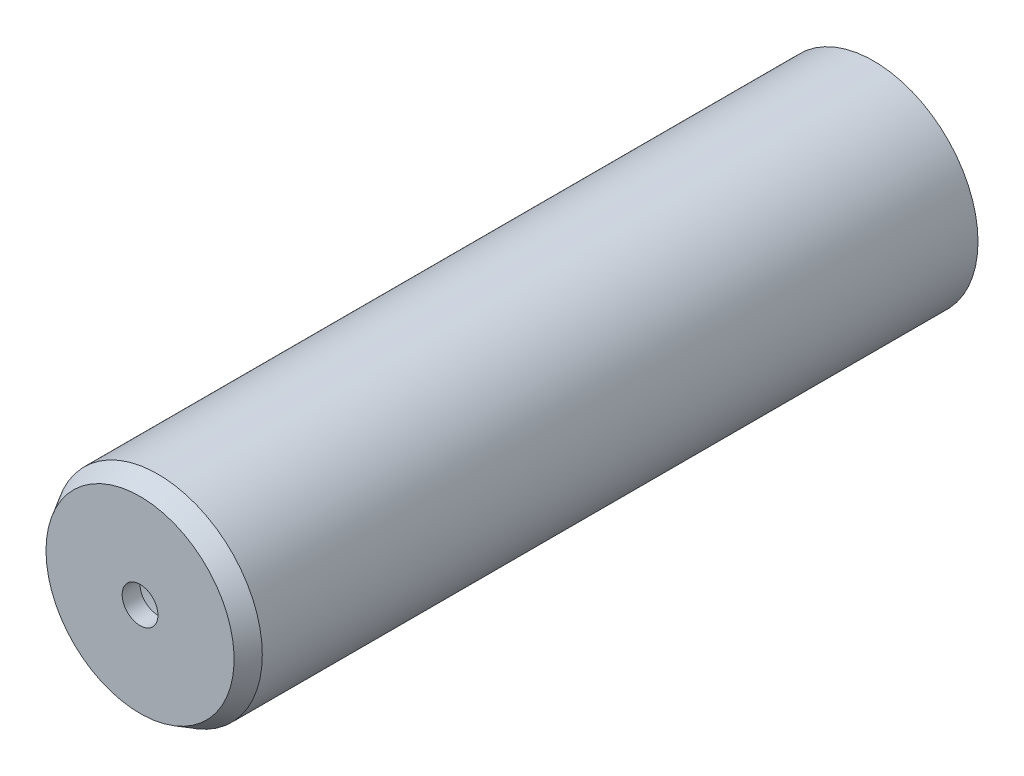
ISO-10303-21;
HEADER;
FILE_DESCRIPTION(('STEP AP214'),'2;1');
FILE_NAME('part.step','',(''),(''),'','','');
FILE_SCHEMA(('AUTOMOTIVE_DESIGN { 1 0 10303 214 1 1 1 1 }'));
ENDSEC;
DATA;
#1=APPLICATION_CONTEXT('core data for automotive mechanical design processes');
#2=APPLICATION_PROTOCOL_DEFINITION('international standard','automotive_design',2000,#1);
#3=PRODUCT_CONTEXT('',#1,'mechanical');
#4=PRODUCT('Part','Part','',(#3));
#5=PRODUCT_RELATED_PRODUCT_CATEGORY('part','',(#4));
#6=PRODUCT_DEFINITION_FORMATION('','',#4);
#7=PRODUCT_DEFINITION_CONTEXT('part definition',#1,'design');
#8=PRODUCT_DEFINITION('design','',#6,#7);
#9=PRODUCT_DEFINITION_SHAPE('','',#8);
#10=(LENGTH_UNIT() NAMED_UNIT(*) SI_UNIT(.MILLI.,.METRE.));
#11=(NAMED_UNIT(*) PLANE_ANGLE_UNIT() SI_UNIT($,.RADIAN.));
#12=(NAMED_UNIT(*) SI_UNIT($,.STERADIAN.) SOLID_ANGLE_UNIT());
#13=UNCERTAINTY_MEASURE_WITH_UNIT(LENGTH_MEASURE(1.E-05),#10,'distance_accuracy_value','');
#14=(GEOMETRIC_REPRESENTATION_CONTEXT(3) GLOBAL_UNCERTAINTY_ASSIGNED_CONTEXT((#13)) GLOBAL_UNIT_ASSIGNED_CONTEXT((#10,
#11,#12)) REPRESENTATION_CONTEXT('',''));
#15=CARTESIAN_POINT('',(0.,0.,0.));
#16=DIRECTION('',(0.,0.,1.));
#17=DIRECTION('',(1.,0.,0.));
#18=AXIS2_PLACEMENT_3D('',#15,#16,#17);
#19=CARTESIAN_POINT('',(-1.95017537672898,9.604,20.));
#20=DIRECTION('',(-0.98,-0.198997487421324,0.));
#21=DIRECTION('',(0.198997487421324,-0.98,0.));
#22=AXIS2_PLACEMENT_3D('',#19,#20,#21);
#23=PLANE('',#22);
#24=DIRECTION('',(0.,0.,-1.));
#25=VECTOR('',#24,1.);
#26=CARTESIAN_POINT('',(-2.98496231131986,14.7,20.));
#27=LINE('',#26,#25);
#28=CARTESIAN_POINT('',(-2.98496231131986,14.7,20.));
#29=VERTEX_POINT('',#28);
#30=CARTESIAN_POINT('',(-2.98496231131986,14.7,6.));
#31=VERTEX_POINT('',#30);
#32=EDGE_CURVE('E102',#29,#31,#27,.T.);
#33=ORIENTED_EDGE('',*,*,#32,.T.);
#34=DIRECTION('',(-0.198997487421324,0.98,0.));
#35=VECTOR('',#34,1.);
#36=CARTESIAN_POINT('',(-1.95017537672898,9.604,6.));
#37=LINE('',#36,#35);
#38=CARTESIAN_POINT('',(-1.95017537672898,9.604,6.));
#39=VERTEX_POINT('',#38);
#40=EDGE_CURVE('E96',#39,#31,#37,.T.);
#41=ORIENTED_EDGE('',*,*,#40,.F.);
#42=DIRECTION('',(0.,0.,-1.));
#43=VECTOR('',#42,1.);
#44=CARTESIAN_POINT('',(-1.95017537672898,9.604,20.));
#45=LINE('',#44,#43);
#46=CARTESIAN_POINT('',(-1.95017537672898,9.604,6.26261290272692));
#47=VERTEX_POINT('',#46);
#48=EDGE_CURVE('E95',#47,#39,#45,.T.);
#49=ORIENTED_EDGE('',*,*,#48,.F.);
#50=DIRECTION('',(0.0680611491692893,-0.335179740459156,-0.939692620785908));
#51=VECTOR('',#50,1.);
#52=CARTESIAN_POINT('',(-2.82877139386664,13.9308088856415,18.3930309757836));
#53=LINE('',#52,#51);
#54=CARTESIAN_POINT('',(-2.9451628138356,14.504,20.));
#55=VERTEX_POINT('',#54);
#56=EDGE_CURVE('E131',#47,#55,#53,.F.);
#57=ORIENTED_EDGE('',*,*,#56,.T.);
#58=DIRECTION('',(-0.198997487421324,0.98,0.));
#59=VECTOR('',#58,1.);
#60=CARTESIAN_POINT('',(-1.95017537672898,9.604,20.));
#61=LINE('',#60,#59);
#62=EDGE_CURVE('E104',#55,#29,#61,.T.);
#63=ORIENTED_EDGE('',*,*,#62,.T.);
#64=EDGE_LOOP('',(#33,#41,#49,#57,#63));
#65=FACE_BOUND('',#64,.T.);
#66=ADVANCED_FACE('F35',(#65),#23,.T.);
#67=CARTESIAN_POINT('',(0.,10.,20.));
#68=DIRECTION('',(0.198997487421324,-0.98,0.));
#69=DIRECTION('',(0.98,0.198997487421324,0.));
#70=AXIS2_PLACEMENT_3D('',#67,#68,#69);
#71=PLANE('',#70);
#72=ORIENTED_EDGE('',*,*,#48,.T.);
#73=DIRECTION('',(-0.98,-0.198997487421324,0.));
#74=VECTOR('',#73,1.);
#75=CARTESIAN_POINT('',(0.,10.,6.));
#76=LINE('',#75,#74);
#77=CARTESIAN_POINT('',(0.,10.,6.));
#78=VERTEX_POINT('',#77);
#79=EDGE_CURVE('E82',#78,#39,#76,.T.);
#80=ORIENTED_EDGE('',*,*,#79,.F.);
#81=DIRECTION('',(0.,0.,-1.));
#82=VECTOR('',#81,1.);
#83=CARTESIAN_POINT('',(0.,10.,20.));
#84=LINE('',#83,#82);
#85=CARTESIAN_POINT('',(0.,10.,6.26261290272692));
#86=VERTEX_POINT('',#85);
#87=EDGE_CURVE('E92',#86,#78,#84,.T.);
#88=ORIENTED_EDGE('',*,*,#87,.F.);
#89=DIRECTION('',(-0.98,-0.198997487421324,0.));
#90=VECTOR('',#89,1.);
#91=CARTESIAN_POINT('',(0.,10.,6.26261290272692));
#92=LINE('',#91,#90);
#93=EDGE_CURVE('E129',#86,#47,#92,.T.);
#94=ORIENTED_EDGE('',*,*,#93,.T.);
#95=EDGE_LOOP('',(#72,#80,#88,#94));
#96=FACE_BOUND('',#95,.T.);
#97=ADVANCED_FACE('F90',(#96),#71,.T.);
#98=CARTESIAN_POINT('',(0.,15.,20.));
#99=DIRECTION('',(1.,0.,0.));
#100=DIRECTION('',(0.,1.,0.));
#101=AXIS2_PLACEMENT_3D('',#98,#99,#100);
#102=PLANE('',#101);
#103=ORIENTED_EDGE('',*,*,#87,.T.);
#104=DIRECTION('',(0.,-1.,0.));
#105=VECTOR('',#104,1.);
#106=CARTESIAN_POINT('',(0.,15.,6.));
#107=LINE('',#106,#105);
#108=CARTESIAN_POINT('',(0.,15.,6.));
#109=VERTEX_POINT('',#108);
#110=EDGE_CURVE('E79',#109,#78,#107,.T.);
#111=ORIENTED_EDGE('',*,*,#110,.F.);
#112=DIRECTION('',(0.,0.,-1.));
#113=VECTOR('',#112,1.);
#114=CARTESIAN_POINT('',(0.,15.,20.));
#115=LINE('',#114,#113);
#116=CARTESIAN_POINT('',(0.,15.,19.7252522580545));
#117=VERTEX_POINT('',#116);
#118=EDGE_CURVE('E100',#117,#109,#115,.T.);
#119=ORIENTED_EDGE('',*,*,#118,.F.);
#120=DIRECTION('',(0.,0.34816150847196,0.937434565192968));
#121=VECTOR('',#120,1.);
#122=CARTESIAN_POINT('',(0.,15.0896717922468,19.9666960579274));
#123=LINE('',#122,#121);
#124=EDGE_CURVE('E43',#117,#86,#123,.F.);
#125=ORIENTED_EDGE('',*,*,#124,.T.);
#126=EDGE_LOOP('',(#103,#111,#119,#125));
#127=FACE_BOUND('',#126,.T.);
#128=ADVANCED_FACE('F98',(#127),#102,.T.);
#129=CARTESIAN_POINT('',(0.,0.,0.));
#130=DIRECTION('',(0.,0.,1.));
#131=DIRECTION('',(1.,0.,0.));
#132=AXIS2_PLACEMENT_3D('',#129,#130,#131);
#133=PLANE('',#132);
#134=CARTESIAN_POINT('',(0.,0.,0.));
#135=DIRECTION('',(0.,0.,1.));
#136=DIRECTION('',(1.,0.,0.));
#137=AXIS2_PLACEMENT_3D('',#134,#135,#136);
#138=CIRCLE('',#137,17.5);
#139=CARTESIAN_POINT('',(17.5,0.,0.));
#140=VERTEX_POINT('',#139);
#141=EDGE_CURVE('E120',#140,#140,#138,.T.);
#142=ORIENTED_EDGE('',*,*,#141,.F.);
#143=EDGE_LOOP('',(#142));
#144=FACE_BOUND('',#143,.T.);
#145=CARTESIAN_POINT('',(0.,0.,0.));
#146=DIRECTION('',(0.,0.,1.));
#147=DIRECTION('',(1.,0.,0.));
#148=AXIS2_PLACEMENT_3D('',#145,#146,#147);
#149=CIRCLE('',#148,15.);
#150=CARTESIAN_POINT('',(15.,0.,0.));
#151=VERTEX_POINT('',#150);
#152=EDGE_CURVE('E117',#151,#151,#149,.T.);
#153=ORIENTED_EDGE('',*,*,#152,.T.);
#154=EDGE_LOOP('',(#153));
#155=FACE_BOUND('',#154,.T.);
#156=ADVANCED_FACE('F162',(#144,#155),#133,.F.);
#157=CARTESIAN_POINT('',(0.,0.,120.));
#158=DIRECTION('',(0.,0.,-1.));
#159=DIRECTION('',(-1.,0.,0.));
#160=AXIS2_PLACEMENT_3D('',#157,#158,#159);
#161=CYLINDRICAL_SURFACE('',#160,17.5);
#162=CARTESIAN_POINT('',(0.,0.,120.));
#163=DIRECTION('',(0.,0.,1.));
#164=DIRECTION('',(1.,0.,0.));
#165=AXIS2_PLACEMENT_3D('',#162,#163,#164);
#166=CIRCLE('',#165,17.5);
#167=CARTESIAN_POINT('',(-17.5,0.,120.));
#168=VERTEX_POINT('',#167);
#169=EDGE_CURVE('E126',#168,#168,#166,.F.);
#170=ORIENTED_EDGE('',*,*,#169,.T.);
#171=EDGE_LOOP('',(#170));
#172=FACE_BOUND('',#171,.T.);
#173=ORIENTED_EDGE('',*,*,#141,.T.);
#174=EDGE_LOOP('',(#173));
#175=FACE_BOUND('',#174,.T.);
#176=ADVANCED_FACE('F178',(#172,#175),#161,.T.);
#177=CARTESIAN_POINT('',(0.,0.,120.));
#178=DIRECTION('',(0.,0.,-1.));
#179=DIRECTION('',(-1.,0.,0.));
#180=AXIS2_PLACEMENT_3D('',#177,#178,#179);
#181=CYLINDRICAL_SURFACE('',#180,15.);
#182=ORIENTED_EDGE('',*,*,#152,.F.);
#183=EDGE_LOOP('',(#182));
#184=FACE_BOUND('',#183,.T.);
#185=ORIENTED_EDGE('',*,*,#32,.F.);
#186=CARTESIAN_POINT('',(7.08851380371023E-13,-7.05512037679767E-12,20.));
#187=DIRECTION('',(0.,0.,-1.));
#188=DIRECTION('',(1.,0.,0.));
#189=AXIS2_PLACEMENT_3D('',#186,#187,#188);
#190=CIRCLE('',#189,15.0000000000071);
#191=CARTESIAN_POINT('',(-0.552677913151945,14.9898147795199,20.));
#192=VERTEX_POINT('',#191);
#193=EDGE_CURVE('E139',#29,#192,#190,.T.);
#194=ORIENTED_EDGE('',*,*,#193,.T.);
#195=CARTESIAN_POINT('',(0.,0.,-20.6626658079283));
#196=DIRECTION('',(-0.186996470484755,0.92089876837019,-0.34202014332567));
#197=DIRECTION('',(0.0680611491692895,-0.335179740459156,-0.939692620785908));
#198=AXIS2_PLACEMENT_3D('',#195,#196,#197);
#199=ELLIPSE('',#198,43.8570660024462,15.);
#200=EDGE_CURVE('E11',#192,#117,#199,.T.);
#201=ORIENTED_EDGE('',*,*,#200,.T.);
#202=ORIENTED_EDGE('',*,*,#118,.T.);
#203=CARTESIAN_POINT('',(0.,1.196959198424E-13,6.));
#204=DIRECTION('',(0.,0.,-1.));
#205=DIRECTION('',(-1.,0.,0.));
#206=AXIS2_PLACEMENT_3D('',#203,#204,#205);
#207=CIRCLE('',#206,14.9999999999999);
#208=EDGE_CURVE('E50',#31,#109,#207,.T.);
#209=ORIENTED_EDGE('',*,*,#208,.F.);
#210=EDGE_LOOP('',(#185,#194,#201,#202,#209));
#211=FACE_BOUND('',#210,.T.);
#212=CARTESIAN_POINT('',(0.,0.,120.));
#213=DIRECTION('',(0.,0.,1.));
#214=DIRECTION('',(1.,0.,0.));
#215=AXIS2_PLACEMENT_3D('',#212,#213,#214);
#216=CIRCLE('',#215,15.);
#217=CARTESIAN_POINT('',(15.,0.,120.));
#218=VERTEX_POINT('',#217);
#219=EDGE_CURVE('E111',#218,#218,#216,.T.);
#220=ORIENTED_EDGE('',*,*,#219,.T.);
#221=EDGE_LOOP('',(#220));
#222=FACE_BOUND('',#221,.T.);
#223=ADVANCED_FACE('F142',(#184,#211,#222),#181,.F.);
#224=CARTESIAN_POINT('',(0.,0.,120.));
#225=DIRECTION('',(0.,0.,1.));
#226=DIRECTION('',(1.,0.,0.));
#227=AXIS2_PLACEMENT_3D('',#224,#225,#226);
#228=PLANE('',#227);
#229=CARTESIAN_POINT('',(0.,0.,120.));
#230=DIRECTION('',(0.,0.,1.));
#231=DIRECTION('',(1.,0.,0.));
#232=AXIS2_PLACEMENT_3D('',#229,#230,#231);
#233=CIRCLE('',#232,3.);
#234=CARTESIAN_POINT('',(3.,0.,120.));
#235=VERTEX_POINT('',#234);
#236=EDGE_CURVE('E112',#235,#235,#233,.T.);
#237=ORIENTED_EDGE('',*,*,#236,.T.);
#238=EDGE_LOOP('',(#237));
#239=FACE_BOUND('',#238,.T.);
#240=ORIENTED_EDGE('',*,*,#219,.F.);
#241=EDGE_LOOP('',(#240));
#242=FACE_BOUND('',#241,.T.);
#243=ADVANCED_FACE('F171',(#239,#242),#228,.F.);
#244=CARTESIAN_POINT('',(0.,0.,123.));
#245=DIRECTION('',(0.,0.,1.));
#246=DIRECTION('',(1.,0.,0.));
#247=AXIS2_PLACEMENT_3D('',#244,#245,#246);
#248=PLANE('',#247);
#249=CARTESIAN_POINT('',(0.,0.,123.));
#250=DIRECTION('',(0.,0.,1.));
#251=DIRECTION('',(1.,0.,0.));
#252=AXIS2_PLACEMENT_3D('',#249,#250,#251);
#253=CIRCLE('',#252,15.7679491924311);
#254=CARTESIAN_POINT('',(-15.7679491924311,0.,123.));
#255=VERTEX_POINT('',#254);
#256=EDGE_CURVE('E123',#255,#255,#253,.T.);
#257=ORIENTED_EDGE('',*,*,#256,.T.);
#258=EDGE_LOOP('',(#257));
#259=FACE_BOUND('',#258,.T.);
#260=CARTESIAN_POINT('',(0.,0.,123.));
#261=DIRECTION('',(0.,0.,1.));
#262=DIRECTION('',(1.,0.,0.));
#263=AXIS2_PLACEMENT_3D('',#260,#261,#262);
#264=CIRCLE('',#263,3.);
#265=CARTESIAN_POINT('',(3.,0.,123.));
#266=VERTEX_POINT('',#265);
#267=EDGE_CURVE('E108',#266,#266,#264,.T.);
#268=ORIENTED_EDGE('',*,*,#267,.F.);
#269=EDGE_LOOP('',(#268));
#270=FACE_BOUND('',#269,.T.);
#271=ADVANCED_FACE('F167',(#259,#270),#248,.T.);
#272=CARTESIAN_POINT('',(0.,0.,123.));
#273=DIRECTION('',(0.,0.,-1.));
#274=DIRECTION('',(-1.,0.,0.));
#275=AXIS2_PLACEMENT_3D('',#272,#273,#274);
#276=CYLINDRICAL_SURFACE('',#275,3.);
#277=ORIENTED_EDGE('',*,*,#267,.T.);
#278=EDGE_LOOP('',(#277));
#279=FACE_BOUND('',#278,.T.);
#280=ORIENTED_EDGE('',*,*,#236,.F.);
#281=EDGE_LOOP('',(#280));
#282=FACE_BOUND('',#281,.T.);
#283=ADVANCED_FACE('F163',(#279,#282),#276,.F.);
#284=CARTESIAN_POINT('',(0.,0.,123.));
#285=DIRECTION('',(0.,0.,-1.));
#286=DIRECTION('',(-1.,0.,0.));
#287=AXIS2_PLACEMENT_3D('',#284,#285,#286);
#288=CONICAL_SURFACE('',#287,15.7679491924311,0.523598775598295);
#289=CARTESIAN_POINT('',(-17.5,0.,120.));
#290=CARTESIAN_POINT('',(-17.4819578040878,0.,120.03125));
#291=CARTESIAN_POINT('',(-17.4639156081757,0.,120.0625));
#292=CARTESIAN_POINT('',(-17.4278312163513,0.,120.125));
#293=CARTESIAN_POINT('',(-17.4097890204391,0.,120.15625));
#294=CARTESIAN_POINT('',(-17.3737046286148,0.,120.21875));
#295=CARTESIAN_POINT('',(-17.3556624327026,0.,120.25));
#296=CARTESIAN_POINT('',(-17.3195780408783,0.,120.3125));
#297=CARTESIAN_POINT('',(-17.3015358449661,0.,120.34375));
#298=CARTESIAN_POINT('',(-17.2654514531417,0.,120.40625));
#299=CARTESIAN_POINT('',(-17.2474092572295,0.,120.4375));
#300=CARTESIAN_POINT('',(-17.2113248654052,0.,120.5));
#301=CARTESIAN_POINT('',(-17.193282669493,0.,120.53125));
#302=CARTESIAN_POINT('',(-17.1571982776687,0.,120.59375));
#303=CARTESIAN_POINT('',(-17.1391560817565,0.,120.625));
#304=CARTESIAN_POINT('',(-17.1030716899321,0.,120.6875));
#305=CARTESIAN_POINT('',(-17.08502949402,0.,120.71875));
#306=CARTESIAN_POINT('',(-17.0489451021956,0.,120.78125));
#307=CARTESIAN_POINT('',(-17.0309029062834,0.,120.8125));
#308=CARTESIAN_POINT('',(-16.9948185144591,0.,120.875));
#309=CARTESIAN_POINT('',(-16.9767763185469,0.,120.90625));
#310=CARTESIAN_POINT('',(-16.9406919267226,0.,120.96875));
#311=CARTESIAN_POINT('',(-16.9226497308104,0.,121.));
#312=CARTESIAN_POINT('',(-16.886565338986,0.,121.0625));
#313=CARTESIAN_POINT('',(-16.8685231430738,0.,121.09375));
#314=CARTESIAN_POINT('',(-16.8324387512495,0.,121.15625));
#315=CARTESIAN_POINT('',(-16.8143965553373,0.,121.1875));
#316=CARTESIAN_POINT('',(-16.778312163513,0.,121.25));
#317=CARTESIAN_POINT('',(-16.7602699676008,0.,121.28125));
#318=CARTESIAN_POINT('',(-16.7241855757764,0.,121.34375));
#319=CARTESIAN_POINT('',(-16.7061433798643,0.,121.375));
#320=CARTESIAN_POINT('',(-16.6700589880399,0.,121.4375));
#321=CARTESIAN_POINT('',(-16.6520167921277,0.,121.46875));
#322=CARTESIAN_POINT('',(-16.6159324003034,0.,121.53125));
#323=CARTESIAN_POINT('',(-16.5978902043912,0.,121.5625));
#324=CARTESIAN_POINT('',(-16.5618058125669,0.,121.625));
#325=CARTESIAN_POINT('',(-16.5437636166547,0.,121.65625));
#326=CARTESIAN_POINT('',(-16.5076792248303,0.,121.71875));
#327=CARTESIAN_POINT('',(-16.4896370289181,0.,121.75));
#328=CARTESIAN_POINT('',(-16.4535526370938,0.,121.8125));
#329=CARTESIAN_POINT('',(-16.4355104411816,0.,121.84375));
#330=CARTESIAN_POINT('',(-16.3994260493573,0.,121.90625));
#331=CARTESIAN_POINT('',(-16.3813838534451,0.,121.9375));
#332=CARTESIAN_POINT('',(-16.3452994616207,0.,122.));
#333=CARTESIAN_POINT('',(-16.3272572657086,0.,122.03125));
#334=CARTESIAN_POINT('',(-16.2911728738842,0.,122.09375));
#335=CARTESIAN_POINT('',(-16.273130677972,0.,122.125));
#336=CARTESIAN_POINT('',(-16.2370462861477,0.,122.1875));
#337=CARTESIAN_POINT('',(-16.2190040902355,0.,122.21875));
#338=CARTESIAN_POINT('',(-16.1829196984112,0.,122.28125));
#339=CARTESIAN_POINT('',(-16.164877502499,0.,122.3125));
#340=CARTESIAN_POINT('',(-16.1287931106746,0.,122.375));
#341=CARTESIAN_POINT('',(-16.1107509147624,0.,122.40625));
#342=CARTESIAN_POINT('',(-16.0746665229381,0.,122.46875));
#343=CARTESIAN_POINT('',(-16.0566243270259,0.,122.5));
#344=CARTESIAN_POINT('',(-16.0205399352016,0.,122.5625));
#345=CARTESIAN_POINT('',(-16.0024977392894,0.,122.59375));
#346=CARTESIAN_POINT('',(-15.966413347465,0.,122.65625));
#347=CARTESIAN_POINT('',(-15.9483711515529,0.,122.6875));
#348=CARTESIAN_POINT('',(-15.9122867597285,0.,122.75));
#349=CARTESIAN_POINT('',(-15.8942445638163,0.,122.78125));
#350=CARTESIAN_POINT('',(-15.858160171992,0.,122.84375));
#351=CARTESIAN_POINT('',(-15.8401179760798,0.,122.875));
#352=CARTESIAN_POINT('',(-15.8040335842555,0.,122.9375));
#353=CARTESIAN_POINT('',(-15.7859913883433,0.,122.96875));
#354=CARTESIAN_POINT('',(-15.7679491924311,0.,123.));
#355=B_SPLINE_CURVE_WITH_KNOTS('',3,(#289,#290,#291,#292,#293,#294,#295,#296,#297,#298,#299,
#300,#301,#302,#303,#304,#305,#306,#307,#308,#309,#310,#311,#312,#313,#314,#315,#316,#317,#318,
#319,#320,#321,#322,#323,#324,#325,#326,#327,#328,#329,#330,#331,#332,#333,#334,#335,#336,#337,
#338,#339,#340,#341,#342,#343,#344,#345,#346,#347,#348,#349,#350,#351,#352,#353,#354),
.UNSPECIFIED.,.F.,.F.,(4,2,2,2,2,2,2,2,2,2,2,2,2,2,2,2,2,2,2,2,2,2,2,2,2,2,2,2,2,2,2,2,4),(0.,
0.108253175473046,0.216506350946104,0.324759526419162,0.43301270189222,0.54126587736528,
0.649519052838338,0.757772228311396,0.866025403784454,0.974278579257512,1.08253175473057,
1.19078493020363,1.29903810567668,1.40729128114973,1.51554445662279,1.62379763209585,
1.73205080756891,1.84030398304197,1.94855715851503,2.05681033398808,2.16506350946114,
2.2733166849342,2.38156986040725,2.4898230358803,2.59807621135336,2.70632938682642,
2.81458256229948,2.92283573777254,3.0310889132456,3.13934208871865,3.24759526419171,
3.35584843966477,3.46410161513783),.UNSPECIFIED.);
#356=EDGE_CURVE('BSEAM166',#168,#255,#355,.T.);
#357=ORIENTED_EDGE('',*,*,#169,.F.);
#358=ORIENTED_EDGE('',*,*,#256,.F.);
#359=ORIENTED_EDGE('',*,*,#356,.T.);
#360=ORIENTED_EDGE('',*,*,#356,.F.);
#361=EDGE_LOOP('',(#357,#359,#358,#360));
#362=FACE_BOUND('',#361,.T.);
#363=ADVANCED_FACE('F166',(#362),#288,.T.);
#364=CARTESIAN_POINT('',(7.08851380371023E-13,-7.05512037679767E-12,20.));
#365=DIRECTION('',(0.,0.,1.));
#366=DIRECTION('',(1.,0.,0.));
#367=AXIS2_PLACEMENT_3D('',#364,#365,#366);
#368=PLANE('',#367);
#369=ORIENTED_EDGE('',*,*,#62,.F.);
#370=DIRECTION('',(0.98,0.198997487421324,0.));
#371=VECTOR('',#370,1.);
#372=CARTESIAN_POINT('',(-2.9451628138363,14.5039999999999,20.));
#373=LINE('',#372,#371);
#374=EDGE_CURVE('E133',#55,#192,#373,.T.);
#375=ORIENTED_EDGE('',*,*,#374,.T.);
#376=ORIENTED_EDGE('',*,*,#193,.F.);
#377=EDGE_LOOP('',(#369,#375,#376));
#378=FACE_BOUND('',#377,.T.);
#379=ADVANCED_FACE('F138',(#378),#368,.T.);
#380=CARTESIAN_POINT('',(0.,10.,6.26261290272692));
#381=DIRECTION('',(-0.186996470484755,0.92089876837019,-0.34202014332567));
#382=DIRECTION('',(-0.98,-0.198997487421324,0.));
#383=AXIS2_PLACEMENT_3D('',#380,#381,#382);
#384=PLANE('',#383);
#385=ORIENTED_EDGE('',*,*,#200,.F.);
#386=ORIENTED_EDGE('',*,*,#374,.F.);
#387=ORIENTED_EDGE('',*,*,#56,.F.);
#388=ORIENTED_EDGE('',*,*,#93,.F.);
#389=ORIENTED_EDGE('',*,*,#124,.F.);
#390=EDGE_LOOP('',(#385,#386,#387,#388,#389));
#391=FACE_BOUND('',#390,.T.);
#392=ADVANCED_FACE('F37',(#391),#384,.F.);
#393=CARTESIAN_POINT('',(0.,1.196959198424E-13,6.));
#394=DIRECTION('',(0.,0.,-1.));
#395=DIRECTION('',(-1.,0.,0.));
#396=AXIS2_PLACEMENT_3D('',#393,#394,#395);
#397=PLANE('',#396);
#398=ORIENTED_EDGE('',*,*,#208,.T.);
#399=ORIENTED_EDGE('',*,*,#110,.T.);
#400=ORIENTED_EDGE('',*,*,#79,.T.);
#401=ORIENTED_EDGE('',*,*,#40,.T.);
#402=EDGE_LOOP('',(#398,#399,#400,#401));
#403=FACE_BOUND('',#402,.T.);
#404=ADVANCED_FACE('F81',(#403),#397,.T.);
#405=CLOSED_SHELL('',(#66,#97,#128,#156,#176,#223,#243,#271,#283,#363,#379,#392,#404));
#406=MANIFOLD_SOLID_BREP('B2',#405);
#407=ADVANCED_BREP_SHAPE_REPRESENTATION('',(#18,#406),#14);
#408=SHAPE_DEFINITION_REPRESENTATION(#9,#407);
ENDSEC;
END-ISO-10303-21;
